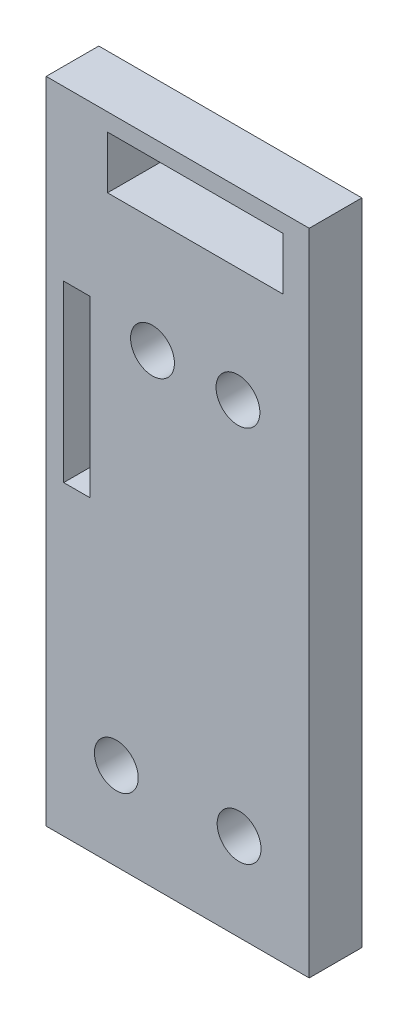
ISO-10303-21;
HEADER;
FILE_DESCRIPTION(('STEP AP214'),'2;1');
FILE_NAME('part.step','',(''),(''),'','','');
FILE_SCHEMA(('AUTOMOTIVE_DESIGN { 1 0 10303 214 1 1 1 1 }'));
ENDSEC;
DATA;
#1=APPLICATION_CONTEXT('core data for automotive mechanical design processes');
#2=APPLICATION_PROTOCOL_DEFINITION('international standard','automotive_design',2000,#1);
#3=PRODUCT_CONTEXT('',#1,'mechanical');
#4=PRODUCT('Part','Part','',(#3));
#5=PRODUCT_RELATED_PRODUCT_CATEGORY('part','',(#4));
#6=PRODUCT_DEFINITION_FORMATION('','',#4);
#7=PRODUCT_DEFINITION_CONTEXT('part definition',#1,'design');
#8=PRODUCT_DEFINITION('design','',#6,#7);
#9=PRODUCT_DEFINITION_SHAPE('','',#8);
#10=(LENGTH_UNIT() NAMED_UNIT(*) SI_UNIT(.MILLI.,.METRE.));
#11=(NAMED_UNIT(*) PLANE_ANGLE_UNIT() SI_UNIT($,.RADIAN.));
#12=(NAMED_UNIT(*) SI_UNIT($,.STERADIAN.) SOLID_ANGLE_UNIT());
#13=UNCERTAINTY_MEASURE_WITH_UNIT(LENGTH_MEASURE(1.E-05),#10,'distance_accuracy_value','');
#14=(GEOMETRIC_REPRESENTATION_CONTEXT(3) GLOBAL_UNCERTAINTY_ASSIGNED_CONTEXT((#13)) GLOBAL_UNIT_ASSIGNED_CONTEXT((#10,
#11,#12)) REPRESENTATION_CONTEXT('',''));
#15=CARTESIAN_POINT('',(0.,0.,0.));
#16=DIRECTION('',(0.,0.,1.));
#17=DIRECTION('',(1.,0.,0.));
#18=AXIS2_PLACEMENT_3D('',#15,#16,#17);
#19=CARTESIAN_POINT('',(298.028662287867,66.7514584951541,6.));
#20=DIRECTION('',(0.,0.,-1.));
#21=DIRECTION('',(-1.,0.,0.));
#22=AXIS2_PLACEMENT_3D('',#19,#20,#21);
#23=PLANE('',#22);
#24=CARTESIAN_POINT('',(319.903662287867,45.726954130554,6.));
#25=DIRECTION('',(0.,0.,1.));
#26=DIRECTION('',(-1.,0.,0.));
#27=AXIS2_PLACEMENT_3D('',#24,#25,#26);
#28=CIRCLE('',#27,2.50000000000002);
#29=CARTESIAN_POINT('',(317.403662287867,45.726954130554,6.));
#30=VERTEX_POINT('',#29);
#31=EDGE_CURVE('E158',#30,#30,#28,.T.);
#32=ORIENTED_EDGE('',*,*,#31,.F.);
#33=EDGE_LOOP('',(#32));
#34=FACE_BOUND('',#33,.T.);
#35=DIRECTION('',(-1.,0.,0.));
#36=VECTOR('',#35,1.);
#37=CARTESIAN_POINT('',(303.028662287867,47.5294663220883,6.));
#38=LINE('',#37,#36);
#39=CARTESIAN_POINT('',(303.028662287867,47.5294663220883,6.));
#40=VERTEX_POINT('',#39);
#41=CARTESIAN_POINT('',(300.028662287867,47.5294663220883,6.));
#42=VERTEX_POINT('',#41);
#43=EDGE_CURVE('E170',#40,#42,#38,.T.);
#44=ORIENTED_EDGE('',*,*,#43,.F.);
#45=DIRECTION('',(0.,1.,0.));
#46=VECTOR('',#45,1.);
#47=CARTESIAN_POINT('',(303.028662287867,27.6308045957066,6.));
#48=LINE('',#47,#46);
#49=CARTESIAN_POINT('',(303.028662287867,27.6308045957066,6.));
#50=VERTEX_POINT('',#49);
#51=EDGE_CURVE('E178',#50,#40,#48,.T.);
#52=ORIENTED_EDGE('',*,*,#51,.F.);
#53=DIRECTION('',(1.,0.,0.));
#54=VECTOR('',#53,1.);
#55=CARTESIAN_POINT('',(300.028662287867,27.6308045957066,6.));
#56=LINE('',#55,#54);
#57=CARTESIAN_POINT('',(300.028662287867,27.6308045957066,6.));
#58=VERTEX_POINT('',#57);
#59=EDGE_CURVE('E175',#58,#50,#56,.T.);
#60=ORIENTED_EDGE('',*,*,#59,.F.);
#61=DIRECTION('',(0.,-1.,0.));
#62=VECTOR('',#61,1.);
#63=CARTESIAN_POINT('',(300.028662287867,47.5294663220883,6.));
#64=LINE('',#63,#62);
#65=EDGE_CURVE('E172',#42,#58,#64,.T.);
#66=ORIENTED_EDGE('',*,*,#65,.F.);
#67=EDGE_LOOP('',(#44,#52,#60,#66));
#68=FACE_BOUND('',#67,.T.);
#69=CARTESIAN_POINT('',(320.028662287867,2.69858037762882,6.));
#70=DIRECTION('',(0.,0.,1.));
#71=DIRECTION('',(1.,0.,0.));
#72=AXIS2_PLACEMENT_3D('',#69,#70,#71);
#73=CIRCLE('',#72,2.50000000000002);
#74=CARTESIAN_POINT('',(322.528662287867,2.69858037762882,6.));
#75=VERTEX_POINT('',#74);
#76=EDGE_CURVE('E207',#75,#75,#73,.T.);
#77=ORIENTED_EDGE('',*,*,#76,.F.);
#78=EDGE_LOOP('',(#77));
#79=FACE_BOUND('',#78,.T.);
#80=DIRECTION('',(0.,-1.,0.));
#81=VECTOR('',#80,1.);
#82=CARTESIAN_POINT('',(298.028662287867,-7.30141962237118,6.));
#83=LINE('',#82,#81);
#84=CARTESIAN_POINT('',(298.028662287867,66.7514584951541,6.));
#85=VERTEX_POINT('',#84);
#86=CARTESIAN_POINT('',(298.028662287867,-7.30141962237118,6.));
#87=VERTEX_POINT('',#86);
#88=EDGE_CURVE('E213',#85,#87,#83,.T.);
#89=ORIENTED_EDGE('',*,*,#88,.T.);
#90=DIRECTION('',(1.,0.,0.));
#91=VECTOR('',#90,1.);
#92=CARTESIAN_POINT('',(328.028662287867,-7.30141962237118,6.));
#93=LINE('',#92,#91);
#94=CARTESIAN_POINT('',(328.028662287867,-7.30141962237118,6.));
#95=VERTEX_POINT('',#94);
#96=EDGE_CURVE('E216',#87,#95,#93,.T.);
#97=ORIENTED_EDGE('',*,*,#96,.T.);
#98=DIRECTION('',(0.,1.,0.));
#99=VECTOR('',#98,1.);
#100=CARTESIAN_POINT('',(328.028662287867,66.7514584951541,6.));
#101=LINE('',#100,#99);
#102=CARTESIAN_POINT('',(328.028662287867,66.7514584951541,6.));
#103=VERTEX_POINT('',#102);
#104=EDGE_CURVE('E219',#95,#103,#101,.T.);
#105=ORIENTED_EDGE('',*,*,#104,.T.);
#106=DIRECTION('',(-1.,0.,0.));
#107=VECTOR('',#106,1.);
#108=CARTESIAN_POINT('',(298.028662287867,66.7514584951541,6.));
#109=LINE('',#108,#107);
#110=EDGE_CURVE('E221',#103,#85,#109,.T.);
#111=ORIENTED_EDGE('',*,*,#110,.T.);
#112=EDGE_LOOP('',(#89,#97,#105,#111));
#113=FACE_BOUND('',#112,.T.);
#114=CARTESIAN_POINT('',(306.028662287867,2.69858037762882,6.));
#115=DIRECTION('',(0.,0.,1.));
#116=DIRECTION('',(-1.,0.,0.));
#117=AXIS2_PLACEMENT_3D('',#114,#115,#116);
#118=CIRCLE('',#117,2.50000000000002);
#119=CARTESIAN_POINT('',(303.528662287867,2.69858037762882,6.));
#120=VERTEX_POINT('',#119);
#121=EDGE_CURVE('E201',#120,#120,#118,.T.);
#122=ORIENTED_EDGE('',*,*,#121,.F.);
#123=EDGE_LOOP('',(#122));
#124=FACE_BOUND('',#123,.T.);
#125=CARTESIAN_POINT('',(310.153662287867,45.726954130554,6.));
#126=DIRECTION('',(0.,0.,1.));
#127=DIRECTION('',(1.,0.,0.));
#128=AXIS2_PLACEMENT_3D('',#125,#126,#127);
#129=CIRCLE('',#128,2.50000000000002);
#130=CARTESIAN_POINT('',(312.653662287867,45.726954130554,6.));
#131=VERTEX_POINT('',#130);
#132=EDGE_CURVE('E164',#131,#131,#129,.T.);
#133=ORIENTED_EDGE('',*,*,#132,.F.);
#134=EDGE_LOOP('',(#133));
#135=FACE_BOUND('',#134,.T.);
#136=DIRECTION('',(-1.,0.,0.));
#137=VECTOR('',#136,1.);
#138=CARTESIAN_POINT('',(325.028662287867,64.7514584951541,6.));
#139=LINE('',#138,#137);
#140=CARTESIAN_POINT('',(325.028662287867,64.7514584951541,6.));
#141=VERTEX_POINT('',#140);
#142=CARTESIAN_POINT('',(305.028662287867,64.7514584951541,6.));
#143=VERTEX_POINT('',#142);
#144=EDGE_CURVE('E122',#141,#143,#139,.T.);
#145=ORIENTED_EDGE('',*,*,#144,.F.);
#146=DIRECTION('',(0.,1.,0.));
#147=VECTOR('',#146,1.);
#148=CARTESIAN_POINT('',(325.028662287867,58.7514584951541,6.));
#149=LINE('',#148,#147);
#150=CARTESIAN_POINT('',(325.028662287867,58.7514584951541,6.));
#151=VERTEX_POINT('',#150);
#152=EDGE_CURVE('E144',#151,#141,#149,.T.);
#153=ORIENTED_EDGE('',*,*,#152,.F.);
#154=DIRECTION('',(1.,0.,0.));
#155=VECTOR('',#154,1.);
#156=CARTESIAN_POINT('',(305.028662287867,58.7514584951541,6.));
#157=LINE('',#156,#155);
#158=CARTESIAN_POINT('',(305.028662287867,58.7514584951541,6.));
#159=VERTEX_POINT('',#158);
#160=EDGE_CURVE('E142',#159,#151,#157,.T.);
#161=ORIENTED_EDGE('',*,*,#160,.F.);
#162=DIRECTION('',(0.,-1.,0.));
#163=VECTOR('',#162,1.);
#164=CARTESIAN_POINT('',(305.028662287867,64.7514584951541,6.));
#165=LINE('',#164,#163);
#166=EDGE_CURVE('E130',#143,#159,#165,.T.);
#167=ORIENTED_EDGE('',*,*,#166,.F.);
#168=EDGE_LOOP('',(#145,#153,#161,#167));
#169=FACE_BOUND('',#168,.T.);
#170=ADVANCED_FACE('F33',(#34,#68,#79,#113,#124,#135,#169),#23,.F.);
#171=CARTESIAN_POINT('',(298.028662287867,66.7514584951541,0.));
#172=DIRECTION('',(0.,0.,-1.));
#173=DIRECTION('',(-1.,0.,0.));
#174=AXIS2_PLACEMENT_3D('',#171,#172,#173);
#175=PLANE('',#174);
#176=CARTESIAN_POINT('',(319.903662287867,45.726954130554,0.));
#177=DIRECTION('',(0.,0.,1.));
#178=DIRECTION('',(-1.,0.,0.));
#179=AXIS2_PLACEMENT_3D('',#176,#177,#178);
#180=CIRCLE('',#179,2.50000000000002);
#181=CARTESIAN_POINT('',(317.403662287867,45.726954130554,0.));
#182=VERTEX_POINT('',#181);
#183=EDGE_CURVE('E138',#182,#182,#180,.T.);
#184=ORIENTED_EDGE('',*,*,#183,.T.);
#185=EDGE_LOOP('',(#184));
#186=FACE_BOUND('',#185,.T.);
#187=DIRECTION('',(0.,1.,0.));
#188=VECTOR('',#187,1.);
#189=CARTESIAN_POINT('',(303.028662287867,27.6308045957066,0.));
#190=LINE('',#189,#188);
#191=CARTESIAN_POINT('',(303.028662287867,27.6308045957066,0.));
#192=VERTEX_POINT('',#191);
#193=CARTESIAN_POINT('',(303.028662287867,47.5294663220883,0.));
#194=VERTEX_POINT('',#193);
#195=EDGE_CURVE('E173',#192,#194,#190,.T.);
#196=ORIENTED_EDGE('',*,*,#195,.T.);
#197=DIRECTION('',(-1.,0.,0.));
#198=VECTOR('',#197,1.);
#199=CARTESIAN_POINT('',(303.028662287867,47.5294663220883,0.));
#200=LINE('',#199,#198);
#201=CARTESIAN_POINT('',(300.028662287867,47.5294663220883,0.));
#202=VERTEX_POINT('',#201);
#203=EDGE_CURVE('E167',#194,#202,#200,.T.);
#204=ORIENTED_EDGE('',*,*,#203,.T.);
#205=DIRECTION('',(0.,-1.,0.));
#206=VECTOR('',#205,1.);
#207=CARTESIAN_POINT('',(300.028662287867,47.5294663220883,0.));
#208=LINE('',#207,#206);
#209=CARTESIAN_POINT('',(300.028662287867,27.6308045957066,0.));
#210=VERTEX_POINT('',#209);
#211=EDGE_CURVE('E183',#202,#210,#208,.T.);
#212=ORIENTED_EDGE('',*,*,#211,.T.);
#213=DIRECTION('',(1.,0.,0.));
#214=VECTOR('',#213,1.);
#215=CARTESIAN_POINT('',(300.028662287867,27.6308045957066,0.));
#216=LINE('',#215,#214);
#217=EDGE_CURVE('E186',#210,#192,#216,.T.);
#218=ORIENTED_EDGE('',*,*,#217,.T.);
#219=EDGE_LOOP('',(#196,#204,#212,#218));
#220=FACE_BOUND('',#219,.T.);
#221=CARTESIAN_POINT('',(320.028662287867,2.69858037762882,0.));
#222=DIRECTION('',(0.,0.,1.));
#223=DIRECTION('',(1.,0.,0.));
#224=AXIS2_PLACEMENT_3D('',#221,#222,#223);
#225=CIRCLE('',#224,2.50000000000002);
#226=CARTESIAN_POINT('',(322.528662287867,2.69858037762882,0.));
#227=VERTEX_POINT('',#226);
#228=EDGE_CURVE('E204',#227,#227,#225,.T.);
#229=ORIENTED_EDGE('',*,*,#228,.T.);
#230=EDGE_LOOP('',(#229));
#231=FACE_BOUND('',#230,.T.);
#232=DIRECTION('',(0.,-1.,0.));
#233=VECTOR('',#232,1.);
#234=CARTESIAN_POINT('',(298.028662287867,-7.30141962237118,0.));
#235=LINE('',#234,#233);
#236=CARTESIAN_POINT('',(298.028662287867,66.7514584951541,0.));
#237=VERTEX_POINT('',#236);
#238=CARTESIAN_POINT('',(298.028662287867,-7.30141962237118,0.));
#239=VERTEX_POINT('',#238);
#240=EDGE_CURVE('E210',#237,#239,#235,.T.);
#241=ORIENTED_EDGE('',*,*,#240,.F.);
#242=DIRECTION('',(-1.,0.,0.));
#243=VECTOR('',#242,1.);
#244=CARTESIAN_POINT('',(298.028662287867,66.7514584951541,0.));
#245=LINE('',#244,#243);
#246=CARTESIAN_POINT('',(328.028662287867,66.7514584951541,0.));
#247=VERTEX_POINT('',#246);
#248=EDGE_CURVE('E217',#247,#237,#245,.T.);
#249=ORIENTED_EDGE('',*,*,#248,.F.);
#250=DIRECTION('',(0.,1.,0.));
#251=VECTOR('',#250,1.);
#252=CARTESIAN_POINT('',(328.028662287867,66.7514584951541,0.));
#253=LINE('',#252,#251);
#254=CARTESIAN_POINT('',(328.028662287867,-7.30141962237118,0.));
#255=VERTEX_POINT('',#254);
#256=EDGE_CURVE('E228',#255,#247,#253,.T.);
#257=ORIENTED_EDGE('',*,*,#256,.F.);
#258=DIRECTION('',(1.,0.,0.));
#259=VECTOR('',#258,1.);
#260=CARTESIAN_POINT('',(328.028662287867,-7.30141962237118,0.));
#261=LINE('',#260,#259);
#262=EDGE_CURVE('E226',#239,#255,#261,.T.);
#263=ORIENTED_EDGE('',*,*,#262,.F.);
#264=EDGE_LOOP('',(#241,#249,#257,#263));
#265=FACE_BOUND('',#264,.T.);
#266=CARTESIAN_POINT('',(306.028662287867,2.69858037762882,0.));
#267=DIRECTION('',(0.,0.,1.));
#268=DIRECTION('',(-1.,0.,0.));
#269=AXIS2_PLACEMENT_3D('',#266,#267,#268);
#270=CIRCLE('',#269,2.50000000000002);
#271=CARTESIAN_POINT('',(303.528662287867,2.69858037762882,0.));
#272=VERTEX_POINT('',#271);
#273=EDGE_CURVE('E200',#272,#272,#270,.T.);
#274=ORIENTED_EDGE('',*,*,#273,.T.);
#275=EDGE_LOOP('',(#274));
#276=FACE_BOUND('',#275,.T.);
#277=CARTESIAN_POINT('',(310.153662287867,45.726954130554,0.));
#278=DIRECTION('',(0.,0.,1.));
#279=DIRECTION('',(1.,0.,0.));
#280=AXIS2_PLACEMENT_3D('',#277,#278,#279);
#281=CIRCLE('',#280,2.50000000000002);
#282=CARTESIAN_POINT('',(312.653662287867,45.726954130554,0.));
#283=VERTEX_POINT('',#282);
#284=EDGE_CURVE('E161',#283,#283,#281,.T.);
#285=ORIENTED_EDGE('',*,*,#284,.T.);
#286=EDGE_LOOP('',(#285));
#287=FACE_BOUND('',#286,.T.);
#288=DIRECTION('',(0.,1.,0.));
#289=VECTOR('',#288,1.);
#290=CARTESIAN_POINT('',(325.028662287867,58.7514584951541,0.));
#291=LINE('',#290,#289);
#292=CARTESIAN_POINT('',(325.028662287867,58.7514584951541,0.));
#293=VERTEX_POINT('',#292);
#294=CARTESIAN_POINT('',(325.028662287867,64.7514584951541,0.));
#295=VERTEX_POINT('',#294);
#296=EDGE_CURVE('E131',#293,#295,#291,.T.);
#297=ORIENTED_EDGE('',*,*,#296,.T.);
#298=DIRECTION('',(-1.,0.,0.));
#299=VECTOR('',#298,1.);
#300=CARTESIAN_POINT('',(325.028662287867,64.7514584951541,0.));
#301=LINE('',#300,#299);
#302=CARTESIAN_POINT('',(305.028662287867,64.7514584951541,0.));
#303=VERTEX_POINT('',#302);
#304=EDGE_CURVE('E56',#295,#303,#301,.T.);
#305=ORIENTED_EDGE('',*,*,#304,.T.);
#306=DIRECTION('',(0.,-1.,0.));
#307=VECTOR('',#306,1.);
#308=CARTESIAN_POINT('',(305.028662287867,64.7514584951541,0.));
#309=LINE('',#308,#307);
#310=CARTESIAN_POINT('',(305.028662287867,58.7514584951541,0.));
#311=VERTEX_POINT('',#310);
#312=EDGE_CURVE('E137',#303,#311,#309,.T.);
#313=ORIENTED_EDGE('',*,*,#312,.T.);
#314=DIRECTION('',(1.,0.,0.));
#315=VECTOR('',#314,1.);
#316=CARTESIAN_POINT('',(305.028662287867,58.7514584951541,0.));
#317=LINE('',#316,#315);
#318=EDGE_CURVE('E150',#311,#293,#317,.T.);
#319=ORIENTED_EDGE('',*,*,#318,.T.);
#320=EDGE_LOOP('',(#297,#305,#313,#319));
#321=FACE_BOUND('',#320,.T.);
#322=ADVANCED_FACE('F246',(#186,#220,#231,#265,#276,#287,#321),#175,.T.);
#323=CARTESIAN_POINT('',(298.028662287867,-7.30141962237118,6.));
#324=DIRECTION('',(1.,0.,0.));
#325=DIRECTION('',(0.,0.,-1.));
#326=AXIS2_PLACEMENT_3D('',#323,#324,#325);
#327=PLANE('',#326);
#328=ORIENTED_EDGE('',*,*,#240,.T.);
#329=DIRECTION('',(0.,0.,-1.));
#330=VECTOR('',#329,1.);
#331=CARTESIAN_POINT('',(298.028662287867,-7.30141962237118,6.));
#332=LINE('',#331,#330);
#333=EDGE_CURVE('E11',#87,#239,#332,.T.);
#334=ORIENTED_EDGE('',*,*,#333,.F.);
#335=ORIENTED_EDGE('',*,*,#88,.F.);
#336=DIRECTION('',(0.,0.,-1.));
#337=VECTOR('',#336,1.);
#338=CARTESIAN_POINT('',(298.028662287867,66.7514584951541,6.));
#339=LINE('',#338,#337);
#340=EDGE_CURVE('E223',#85,#237,#339,.T.);
#341=ORIENTED_EDGE('',*,*,#340,.T.);
#342=EDGE_LOOP('',(#328,#334,#335,#341));
#343=FACE_BOUND('',#342,.T.);
#344=ADVANCED_FACE('F35',(#343),#327,.F.);
#345=CARTESIAN_POINT('',(328.028662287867,-7.30141962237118,6.));
#346=DIRECTION('',(0.,1.,0.));
#347=DIRECTION('',(0.,0.,1.));
#348=AXIS2_PLACEMENT_3D('',#345,#346,#347);
#349=PLANE('',#348);
#350=ORIENTED_EDGE('',*,*,#262,.T.);
#351=DIRECTION('',(0.,0.,-1.));
#352=VECTOR('',#351,1.);
#353=CARTESIAN_POINT('',(328.028662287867,-7.30141962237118,6.));
#354=LINE('',#353,#352);
#355=EDGE_CURVE('E41',#95,#255,#354,.T.);
#356=ORIENTED_EDGE('',*,*,#355,.F.);
#357=ORIENTED_EDGE('',*,*,#96,.F.);
#358=ORIENTED_EDGE('',*,*,#333,.T.);
#359=EDGE_LOOP('',(#350,#356,#357,#358));
#360=FACE_BOUND('',#359,.T.);
#361=ADVANCED_FACE('F257',(#360),#349,.F.);
#362=CARTESIAN_POINT('',(328.028662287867,66.7514584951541,6.));
#363=DIRECTION('',(-1.,0.,0.));
#364=DIRECTION('',(0.,0.,1.));
#365=AXIS2_PLACEMENT_3D('',#362,#363,#364);
#366=PLANE('',#365);
#367=ORIENTED_EDGE('',*,*,#256,.T.);
#368=DIRECTION('',(0.,0.,-1.));
#369=VECTOR('',#368,1.);
#370=CARTESIAN_POINT('',(328.028662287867,66.7514584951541,6.));
#371=LINE('',#370,#369);
#372=EDGE_CURVE('E233',#103,#247,#371,.T.);
#373=ORIENTED_EDGE('',*,*,#372,.F.);
#374=ORIENTED_EDGE('',*,*,#104,.F.);
#375=ORIENTED_EDGE('',*,*,#355,.T.);
#376=EDGE_LOOP('',(#367,#373,#374,#375));
#377=FACE_BOUND('',#376,.T.);
#378=ADVANCED_FACE('F240',(#377),#366,.F.);
#379=CARTESIAN_POINT('',(298.028662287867,66.7514584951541,6.));
#380=DIRECTION('',(0.,-1.,0.));
#381=DIRECTION('',(0.,0.,-1.));
#382=AXIS2_PLACEMENT_3D('',#379,#380,#381);
#383=PLANE('',#382);
#384=ORIENTED_EDGE('',*,*,#248,.T.);
#385=ORIENTED_EDGE('',*,*,#340,.F.);
#386=ORIENTED_EDGE('',*,*,#110,.F.);
#387=ORIENTED_EDGE('',*,*,#372,.T.);
#388=EDGE_LOOP('',(#384,#385,#386,#387));
#389=FACE_BOUND('',#388,.T.);
#390=ADVANCED_FACE('F250',(#389),#383,.F.);
#391=CARTESIAN_POINT('',(320.028662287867,2.69858037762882,6.));
#392=DIRECTION('',(0.,0.,-1.));
#393=DIRECTION('',(-1.,0.,0.));
#394=AXIS2_PLACEMENT_3D('',#391,#392,#393);
#395=CYLINDRICAL_SURFACE('',#394,2.50000000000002);
#396=ORIENTED_EDGE('',*,*,#76,.T.);
#397=EDGE_LOOP('',(#396));
#398=FACE_BOUND('',#397,.T.);
#399=ORIENTED_EDGE('',*,*,#228,.F.);
#400=EDGE_LOOP('',(#399));
#401=FACE_BOUND('',#400,.T.);
#402=ADVANCED_FACE('F275',(#398,#401),#395,.F.);
#403=CARTESIAN_POINT('',(306.028662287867,2.69858037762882,6.));
#404=DIRECTION('',(0.,0.,-1.));
#405=DIRECTION('',(-1.,0.,0.));
#406=AXIS2_PLACEMENT_3D('',#403,#404,#405);
#407=CYLINDRICAL_SURFACE('',#406,2.50000000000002);
#408=ORIENTED_EDGE('',*,*,#121,.T.);
#409=EDGE_LOOP('',(#408));
#410=FACE_BOUND('',#409,.T.);
#411=ORIENTED_EDGE('',*,*,#273,.F.);
#412=EDGE_LOOP('',(#411));
#413=FACE_BOUND('',#412,.T.);
#414=ADVANCED_FACE('F282',(#410,#413),#407,.F.);
#415=CARTESIAN_POINT('',(303.028662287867,47.5294663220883,6.));
#416=DIRECTION('',(0.,-1.,0.));
#417=DIRECTION('',(0.,0.,-1.));
#418=AXIS2_PLACEMENT_3D('',#415,#416,#417);
#419=PLANE('',#418);
#420=ORIENTED_EDGE('',*,*,#203,.F.);
#421=DIRECTION('',(0.,0.,-1.));
#422=VECTOR('',#421,1.);
#423=CARTESIAN_POINT('',(303.028662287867,47.5294663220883,6.));
#424=LINE('',#423,#422);
#425=EDGE_CURVE('E180',#40,#194,#424,.T.);
#426=ORIENTED_EDGE('',*,*,#425,.F.);
#427=ORIENTED_EDGE('',*,*,#43,.T.);
#428=DIRECTION('',(0.,0.,-1.));
#429=VECTOR('',#428,1.);
#430=CARTESIAN_POINT('',(300.028662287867,47.5294663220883,6.));
#431=LINE('',#430,#429);
#432=EDGE_CURVE('E197',#42,#202,#431,.T.);
#433=ORIENTED_EDGE('',*,*,#432,.T.);
#434=EDGE_LOOP('',(#420,#426,#427,#433));
#435=FACE_BOUND('',#434,.T.);
#436=ADVANCED_FACE('F287',(#435),#419,.T.);
#437=CARTESIAN_POINT('',(300.028662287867,47.5294663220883,6.));
#438=DIRECTION('',(1.,0.,0.));
#439=DIRECTION('',(0.,0.,-1.));
#440=AXIS2_PLACEMENT_3D('',#437,#438,#439);
#441=PLANE('',#440);
#442=ORIENTED_EDGE('',*,*,#211,.F.);
#443=ORIENTED_EDGE('',*,*,#432,.F.);
#444=ORIENTED_EDGE('',*,*,#65,.T.);
#445=DIRECTION('',(0.,0.,-1.));
#446=VECTOR('',#445,1.);
#447=CARTESIAN_POINT('',(300.028662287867,27.6308045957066,6.));
#448=LINE('',#447,#446);
#449=EDGE_CURVE('E195',#58,#210,#448,.T.);
#450=ORIENTED_EDGE('',*,*,#449,.T.);
#451=EDGE_LOOP('',(#442,#443,#444,#450));
#452=FACE_BOUND('',#451,.T.);
#453=ADVANCED_FACE('F297',(#452),#441,.T.);
#454=CARTESIAN_POINT('',(300.028662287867,27.6308045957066,6.));
#455=DIRECTION('',(0.,1.,0.));
#456=DIRECTION('',(0.,0.,1.));
#457=AXIS2_PLACEMENT_3D('',#454,#455,#456);
#458=PLANE('',#457);
#459=ORIENTED_EDGE('',*,*,#217,.F.);
#460=ORIENTED_EDGE('',*,*,#449,.F.);
#461=ORIENTED_EDGE('',*,*,#59,.T.);
#462=DIRECTION('',(0.,0.,-1.));
#463=VECTOR('',#462,1.);
#464=CARTESIAN_POINT('',(303.028662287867,27.6308045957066,6.));
#465=LINE('',#464,#463);
#466=EDGE_CURVE('E193',#50,#192,#465,.T.);
#467=ORIENTED_EDGE('',*,*,#466,.T.);
#468=EDGE_LOOP('',(#459,#460,#461,#467));
#469=FACE_BOUND('',#468,.T.);
#470=ADVANCED_FACE('F304',(#469),#458,.T.);
#471=CARTESIAN_POINT('',(303.028662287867,27.6308045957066,6.));
#472=DIRECTION('',(-1.,0.,0.));
#473=DIRECTION('',(0.,0.,1.));
#474=AXIS2_PLACEMENT_3D('',#471,#472,#473);
#475=PLANE('',#474);
#476=ORIENTED_EDGE('',*,*,#195,.F.);
#477=ORIENTED_EDGE('',*,*,#466,.F.);
#478=ORIENTED_EDGE('',*,*,#51,.T.);
#479=ORIENTED_EDGE('',*,*,#425,.T.);
#480=EDGE_LOOP('',(#476,#477,#478,#479));
#481=FACE_BOUND('',#480,.T.);
#482=ADVANCED_FACE('F308',(#481),#475,.T.);
#483=CARTESIAN_POINT('',(310.153662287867,45.726954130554,6.));
#484=DIRECTION('',(0.,0.,-1.));
#485=DIRECTION('',(-1.,0.,0.));
#486=AXIS2_PLACEMENT_3D('',#483,#484,#485);
#487=CYLINDRICAL_SURFACE('',#486,2.50000000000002);
#488=ORIENTED_EDGE('',*,*,#132,.T.);
#489=EDGE_LOOP('',(#488));
#490=FACE_BOUND('',#489,.T.);
#491=ORIENTED_EDGE('',*,*,#284,.F.);
#492=EDGE_LOOP('',(#491));
#493=FACE_BOUND('',#492,.T.);
#494=ADVANCED_FACE('F312',(#490,#493),#487,.F.);
#495=CARTESIAN_POINT('',(319.903662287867,45.726954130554,6.));
#496=DIRECTION('',(0.,0.,-1.));
#497=DIRECTION('',(-1.,0.,0.));
#498=AXIS2_PLACEMENT_3D('',#495,#496,#497);
#499=CYLINDRICAL_SURFACE('',#498,2.50000000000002);
#500=ORIENTED_EDGE('',*,*,#31,.T.);
#501=EDGE_LOOP('',(#500));
#502=FACE_BOUND('',#501,.T.);
#503=ORIENTED_EDGE('',*,*,#183,.F.);
#504=EDGE_LOOP('',(#503));
#505=FACE_BOUND('',#504,.T.);
#506=ADVANCED_FACE('F316',(#502,#505),#499,.F.);
#507=CARTESIAN_POINT('',(325.028662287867,64.7514584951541,6.));
#508=DIRECTION('',(0.,-1.,0.));
#509=DIRECTION('',(0.,0.,-1.));
#510=AXIS2_PLACEMENT_3D('',#507,#508,#509);
#511=PLANE('',#510);
#512=ORIENTED_EDGE('',*,*,#304,.F.);
#513=DIRECTION('',(0.,0.,-1.));
#514=VECTOR('',#513,1.);
#515=CARTESIAN_POINT('',(325.028662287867,64.7514584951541,6.));
#516=LINE('',#515,#514);
#517=EDGE_CURVE('E126',#141,#295,#516,.T.);
#518=ORIENTED_EDGE('',*,*,#517,.F.);
#519=ORIENTED_EDGE('',*,*,#144,.T.);
#520=DIRECTION('',(0.,0.,-1.));
#521=VECTOR('',#520,1.);
#522=CARTESIAN_POINT('',(305.028662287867,64.7514584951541,6.));
#523=LINE('',#522,#521);
#524=EDGE_CURVE('E125',#143,#303,#523,.T.);
#525=ORIENTED_EDGE('',*,*,#524,.T.);
#526=EDGE_LOOP('',(#512,#518,#519,#525));
#527=FACE_BOUND('',#526,.T.);
#528=ADVANCED_FACE('F124',(#527),#511,.T.);
#529=CARTESIAN_POINT('',(305.028662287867,64.7514584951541,6.));
#530=DIRECTION('',(1.,0.,0.));
#531=DIRECTION('',(0.,0.,-1.));
#532=AXIS2_PLACEMENT_3D('',#529,#530,#531);
#533=PLANE('',#532);
#534=ORIENTED_EDGE('',*,*,#312,.F.);
#535=ORIENTED_EDGE('',*,*,#524,.F.);
#536=ORIENTED_EDGE('',*,*,#166,.T.);
#537=DIRECTION('',(0.,0.,-1.));
#538=VECTOR('',#537,1.);
#539=CARTESIAN_POINT('',(305.028662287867,58.7514584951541,6.));
#540=LINE('',#539,#538);
#541=EDGE_CURVE('E139',#159,#311,#540,.T.);
#542=ORIENTED_EDGE('',*,*,#541,.T.);
#543=EDGE_LOOP('',(#534,#535,#536,#542));
#544=FACE_BOUND('',#543,.T.);
#545=ADVANCED_FACE('F134',(#544),#533,.T.);
#546=CARTESIAN_POINT('',(305.028662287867,58.7514584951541,6.));
#547=DIRECTION('',(0.,1.,0.));
#548=DIRECTION('',(0.,0.,1.));
#549=AXIS2_PLACEMENT_3D('',#546,#547,#548);
#550=PLANE('',#549);
#551=ORIENTED_EDGE('',*,*,#318,.F.);
#552=ORIENTED_EDGE('',*,*,#541,.F.);
#553=ORIENTED_EDGE('',*,*,#160,.T.);
#554=DIRECTION('',(0.,0.,-1.));
#555=VECTOR('',#554,1.);
#556=CARTESIAN_POINT('',(325.028662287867,58.7514584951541,6.));
#557=LINE('',#556,#555);
#558=EDGE_CURVE('E48',#151,#293,#557,.T.);
#559=ORIENTED_EDGE('',*,*,#558,.T.);
#560=EDGE_LOOP('',(#551,#552,#553,#559));
#561=FACE_BOUND('',#560,.T.);
#562=ADVANCED_FACE('F325',(#561),#550,.T.);
#563=CARTESIAN_POINT('',(325.028662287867,58.7514584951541,6.));
#564=DIRECTION('',(-1.,0.,0.));
#565=DIRECTION('',(0.,0.,1.));
#566=AXIS2_PLACEMENT_3D('',#563,#564,#565);
#567=PLANE('',#566);
#568=ORIENTED_EDGE('',*,*,#296,.F.);
#569=ORIENTED_EDGE('',*,*,#558,.F.);
#570=ORIENTED_EDGE('',*,*,#152,.T.);
#571=ORIENTED_EDGE('',*,*,#517,.T.);
#572=EDGE_LOOP('',(#568,#569,#570,#571));
#573=FACE_BOUND('',#572,.T.);
#574=ADVANCED_FACE('F328',(#573),#567,.T.);
#575=CLOSED_SHELL('',(#170,#322,#344,#361,#378,#390,#402,#414,#436,#453,#470,#482,#494,#506,
#528,#545,#562,#574));
#576=MANIFOLD_SOLID_BREP('B2',#575);
#577=ADVANCED_BREP_SHAPE_REPRESENTATION('',(#18,#576),#14);
#578=SHAPE_DEFINITION_REPRESENTATION(#9,#577);
ENDSEC;
END-ISO-10303-21;
